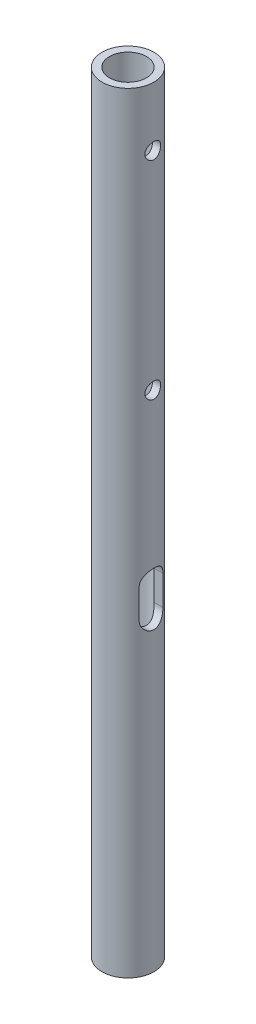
from build123d import *

# Parameters (mm, degrees)
SKETCH1_R               = 11.1125
SKETCH1_R_2             = 7.9375
EXTRUDE1_DEPTH          = 330.2
SKETCH7_R               = 3.3782
CUT_EXTRUDE7_DEPTH      = 331.573766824
SKETCH10_R              = 6.375811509
SKETCH10_R_2            = 6.35
CUT_EXTRUDE8_DEPTH      = 331.573766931
CUT_EXTRUDE9_DEPTH      = 331.573766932
CUT_EXTRUDE9_DEPTH_BACK = 331.573766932


with BuildPart() as part:
    # Sketch1 → Extrude1 (new body)
    with BuildSketch(Plane(origin=(0, 0, 0), x_dir=(1, 0, 0), z_dir=(0, 1, 0))):
        with Locations(Location((0, 0, 0), (0, 0, 270))):
            Circle(SKETCH1_R)
        with Locations(Location((0, 0, 0), (0, 0, 270))):
            Circle(SKETCH1_R_2, mode=Mode.SUBTRACT)
    extrude(amount=EXTRUDE1_DEPTH)

    # Sketch7 → Cut-Extrude7 (cut, through all)
    with BuildSketch(Plane(origin=(0, 0, 0), x_dir=(0, 0, -1), z_dir=(1, 0, 0))):
        with Locations(Location((0, 215.9, 0), (0, 0, 180))):
            Circle(SKETCH7_R)
        with Locations(Location((0, 304.8, 0), (0, 0, 180))):
            Circle(SKETCH7_R)
    extrude(amount=CUT_EXTRUDE7_DEPTH, mode=Mode.SUBTRACT)

    # Sketch10 → Cut-Extrude8 (cut, through all)
    with BuildSketch(Plane(origin=(0, 0, 0), x_dir=(0, 0, -1), z_dir=(1, 0, 0))):
        with Locations((0, 304.8)):
            Circle(SKETCH10_R)
        with Locations((0, 215.9)):
            Circle(SKETCH10_R_2)
    extrude(amount=-CUT_EXTRUDE8_DEPTH, mode=Mode.SUBTRACT)

    # Sketch11 → Cut-Extrude9 (cut, two sides: drawn at the far end of the back side and taken through both)
    with BuildSketch(Plane(origin=(0, 0, 0), x_dir=(0, 0, -1), z_dir=(1, 0, 0)).offset(-CUT_EXTRUDE9_DEPTH_BACK)):
        with BuildLine():
            Line((5.08, 144.78), (5.08, 132.08))
            ThreePointArc((5.08, 132.08), (0, 127), (-5.08, 132.08))
            Line((-5.08, 132.08), (-5.08, 144.78))
            ThreePointArc((-5.08, 144.78), (0, 149.86), (5.08, 144.78))
        make_face()
    extrude(amount=CUT_EXTRUDE9_DEPTH + CUT_EXTRUDE9_DEPTH_BACK, mode=Mode.SUBTRACT)


solid = part.part
